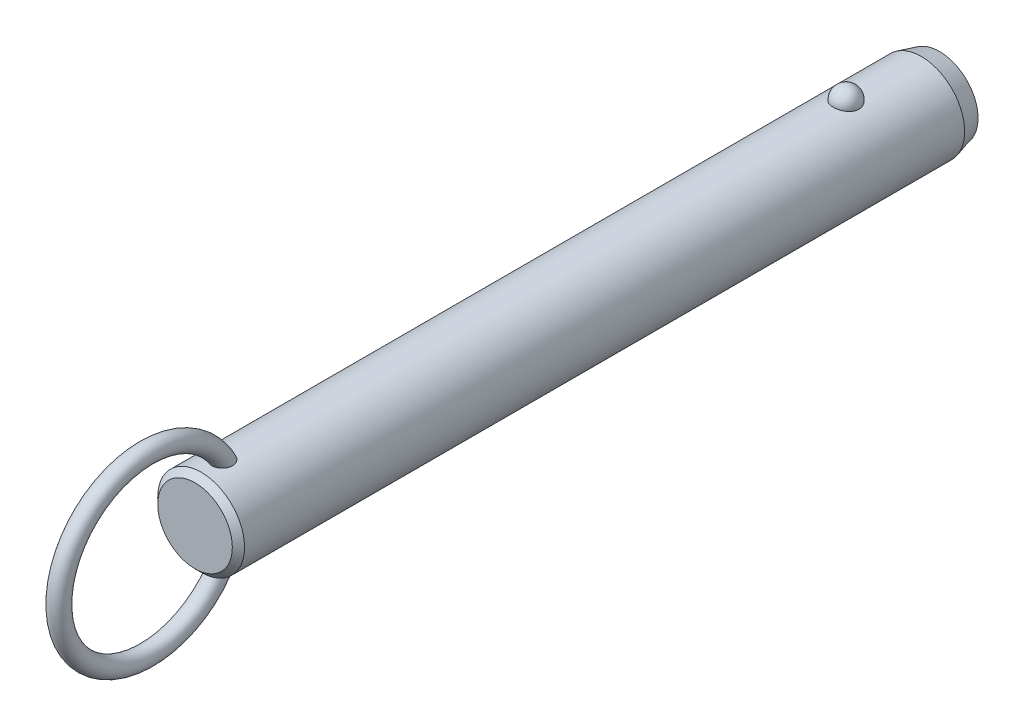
ISO-10303-21;
HEADER;
FILE_DESCRIPTION(('STEP AP214'),'2;1');
FILE_NAME('part.step','',(''),(''),'','','');
FILE_SCHEMA(('AUTOMOTIVE_DESIGN { 1 0 10303 214 1 1 1 1 }'));
ENDSEC;
DATA;
#1=APPLICATION_CONTEXT('core data for automotive mechanical design processes');
#2=APPLICATION_PROTOCOL_DEFINITION('international standard','automotive_design',2000,#1);
#3=PRODUCT_CONTEXT('',#1,'mechanical');
#4=PRODUCT('Part','Part','',(#3));
#5=PRODUCT_RELATED_PRODUCT_CATEGORY('part','',(#4));
#6=PRODUCT_DEFINITION_FORMATION('','',#4);
#7=PRODUCT_DEFINITION_CONTEXT('part definition',#1,'design');
#8=PRODUCT_DEFINITION('design','',#6,#7);
#9=PRODUCT_DEFINITION_SHAPE('','',#8);
#10=(LENGTH_UNIT() NAMED_UNIT(*) SI_UNIT(.MILLI.,.METRE.));
#11=(NAMED_UNIT(*) PLANE_ANGLE_UNIT() SI_UNIT($,.RADIAN.));
#12=(NAMED_UNIT(*) SI_UNIT($,.STERADIAN.) SOLID_ANGLE_UNIT());
#13=UNCERTAINTY_MEASURE_WITH_UNIT(LENGTH_MEASURE(1.E-05),#10,'distance_accuracy_value','');
#14=(GEOMETRIC_REPRESENTATION_CONTEXT(3) GLOBAL_UNCERTAINTY_ASSIGNED_CONTEXT((#13)) GLOBAL_UNIT_ASSIGNED_CONTEXT((#10,
#11,#12)) REPRESENTATION_CONTEXT('',''));
#15=CARTESIAN_POINT('',(0.,0.,0.));
#16=DIRECTION('',(0.,0.,1.));
#17=DIRECTION('',(1.,0.,0.));
#18=AXIS2_PLACEMENT_3D('',#15,#16,#17);
#19=CARTESIAN_POINT('',(0.,0.,96.5));
#20=DIRECTION('',(0.,0.,-1.));
#21=DIRECTION('',(-1.,0.,0.));
#22=AXIS2_PLACEMENT_3D('',#19,#20,#21);
#23=CYLINDRICAL_SURFACE('',#22,7.1);
#24=CARTESIAN_POINT('',(2.0769088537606,6.78943661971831,-2.1));
#25=CARTESIAN_POINT('',(2.07690739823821,6.78943796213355,-1.98268154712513));
#26=CARTESIAN_POINT('',(2.06738130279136,6.79237331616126,-1.86534506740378));
#27=CARTESIAN_POINT('',(2.0295040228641,6.8037853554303,-1.63400788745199));
#28=CARTESIAN_POINT('',(2.00114757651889,6.81226358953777,-1.52000812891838));
#29=CARTESIAN_POINT('',(1.92632025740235,6.83379798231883,-1.29863433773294));
#30=CARTESIAN_POINT('',(1.87985726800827,6.84685214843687,-1.19125744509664));
#31=CARTESIAN_POINT('',(1.76995205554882,6.87608091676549,-0.98604657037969));
#32=CARTESIAN_POINT('',(1.70650980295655,6.8922555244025,-0.88821260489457));
#33=CARTESIAN_POINT('',(1.5638119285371,6.92602930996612,-0.704242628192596));
#34=CARTESIAN_POINT('',(1.4844714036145,6.94363582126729,-0.618173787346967));
#35=CARTESIAN_POINT('',(1.31221746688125,6.97823658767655,-0.460740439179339));
#36=CARTESIAN_POINT('',(1.21930409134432,6.99523084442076,-0.389375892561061));
#37=CARTESIAN_POINT('',(1.02268781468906,7.02666176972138,-0.263547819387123));
#38=CARTESIAN_POINT('',(0.91902009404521,7.04110638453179,-0.209031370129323));
#39=CARTESIAN_POINT('',(0.703548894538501,7.06588726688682,-0.118163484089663));
#40=CARTESIAN_POINT('',(0.591746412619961,7.07622403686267,-0.0818098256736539));
#41=CARTESIAN_POINT('',(0.365557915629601,7.09147068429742,-0.0288711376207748));
#42=CARTESIAN_POINT('',(0.251267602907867,7.09648447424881,-0.0119070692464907));
#43=CARTESIAN_POINT('',(0.0213499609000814,7.10089837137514,0.00304925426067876));
#44=CARTESIAN_POINT('',(-0.0942772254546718,7.10029907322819,0.00104351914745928));
#45=CARTESIAN_POINT('',(-0.321651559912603,7.09360829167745,-0.0216931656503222));
#46=CARTESIAN_POINT('',(-0.433431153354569,7.08760388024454,-0.0421272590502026));
#47=CARTESIAN_POINT('',(-0.651862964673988,7.07086131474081,-0.100729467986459));
#48=CARTESIAN_POINT('',(-0.758515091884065,7.06012307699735,-0.138897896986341));
#49=CARTESIAN_POINT('',(-0.964449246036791,7.03496097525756,-0.232213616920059));
#50=CARTESIAN_POINT('',(-1.06368095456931,7.02051445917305,-0.287465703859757));
#51=CARTESIAN_POINT('',(-1.25145353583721,6.98948740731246,-0.413383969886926));
#52=CARTESIAN_POINT('',(-1.33999321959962,6.97290663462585,-0.48405186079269));
#53=CARTESIAN_POINT('',(-1.50591604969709,6.93898770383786,-0.640594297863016));
#54=CARTESIAN_POINT('',(-1.58302488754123,6.92164094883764,-0.726757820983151));
#55=CARTESIAN_POINT('',(-1.72189320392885,6.8884103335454,-0.91092752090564));
#56=CARTESIAN_POINT('',(-1.78365144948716,6.87252659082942,-1.008934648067));
#57=CARTESIAN_POINT('',(-1.89101272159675,6.84377189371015,-1.21549497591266));
#58=CARTESIAN_POINT('',(-1.93639553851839,6.83094274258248,-1.32416860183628));
#59=CARTESIAN_POINT('',(-2.00874275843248,6.81002070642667,-1.54791500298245));
#60=CARTESIAN_POINT('',(-2.03570774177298,6.80192767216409,-1.66298757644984));
#61=CARTESIAN_POINT('',(-2.07047276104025,6.7914266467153,-1.89571453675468));
#62=CARTESIAN_POINT('',(-2.07835878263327,6.78899315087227,-2.01335491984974));
#63=CARTESIAN_POINT('',(-2.07502083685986,6.79001409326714,-2.24833570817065));
#64=CARTESIAN_POINT('',(-2.06379746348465,6.7934683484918,-2.36567612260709));
#65=CARTESIAN_POINT('',(-2.02263913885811,6.80583442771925,-2.59603194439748));
#66=CARTESIAN_POINT('',(-1.99281127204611,6.81471501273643,-2.70906820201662));
#67=CARTESIAN_POINT('',(-1.91526639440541,6.83691232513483,-2.92836575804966));
#68=CARTESIAN_POINT('',(-1.8675486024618,6.85022924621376,-3.03462676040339));
#69=CARTESIAN_POINT('',(-1.75504492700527,6.87991336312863,-3.23806487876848));
#70=CARTESIAN_POINT('',(-1.69015924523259,6.89629822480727,-3.33518422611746));
#71=CARTESIAN_POINT('',(-1.54505404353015,6.93024852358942,-3.51697105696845));
#72=CARTESIAN_POINT('',(-1.46483385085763,6.94781401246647,-3.60163799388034));
#73=CARTESIAN_POINT('',(-1.29071406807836,6.98225977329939,-3.75654119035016));
#74=CARTESIAN_POINT('',(-1.19675650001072,6.99913673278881,-3.82671308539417));
#75=CARTESIAN_POINT('',(-0.997940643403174,7.03023618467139,-3.9501837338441));
#76=CARTESIAN_POINT('',(-0.89308318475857,7.04445887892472,-4.00348377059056));
#77=CARTESIAN_POINT('',(-0.676902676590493,7.06848365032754,-4.09107242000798));
#78=CARTESIAN_POINT('',(-0.565686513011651,7.0783430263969,-4.12560889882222));
#79=CARTESIAN_POINT('',(-0.338739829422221,7.09282534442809,-4.17575450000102));
#80=CARTESIAN_POINT('',(-0.223009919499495,7.09744899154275,-4.19136617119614));
#81=CARTESIAN_POINT('',(0.00707628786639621,7.10090930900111,-4.20307965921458));
#82=CARTESIAN_POINT('',(0.121410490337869,7.09986531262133,-4.19958377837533));
#83=CARTESIAN_POINT('',(0.347815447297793,7.092380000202,-4.17411564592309));
#84=CARTESIAN_POINT('',(0.459886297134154,7.08593891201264,-4.15214417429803));
#85=CARTESIAN_POINT('',(0.678084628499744,7.06838983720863,-4.09049562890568));
#86=CARTESIAN_POINT('',(0.784237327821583,7.05730369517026,-4.05090137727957));
#87=CARTESIAN_POINT('',(0.988305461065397,7.03163139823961,-3.95511447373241));
#88=CARTESIAN_POINT('',(1.08622031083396,7.01704499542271,-3.89892064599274));
#89=CARTESIAN_POINT('',(1.27284490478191,6.98562668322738,-3.77035541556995));
#90=CARTESIAN_POINT('',(1.36137372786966,6.96876135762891,-3.69772964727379));
#91=CARTESIAN_POINT('',(1.52509486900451,6.93477412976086,-3.53878279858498));
#92=CARTESIAN_POINT('',(1.60028496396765,6.91765218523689,-3.45245943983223));
#93=CARTESIAN_POINT('',(1.73681688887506,6.88465753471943,-3.26658774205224));
#94=CARTESIAN_POINT('',(1.79785966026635,6.86881574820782,-3.16681408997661));
#95=CARTESIAN_POINT('',(1.90265327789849,6.84053157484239,-2.95814408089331));
#96=CARTESIAN_POINT('',(1.94640861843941,6.82808830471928,-2.84925010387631));
#97=CARTESIAN_POINT('',(2.01274378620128,6.80881460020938,-2.63454318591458));
#98=CARTESIAN_POINT('',(2.03676193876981,6.80160856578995,-2.52920574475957));
#99=CARTESIAN_POINT('',(2.06884490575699,6.79191902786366,-2.3159172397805));
#100=CARTESIAN_POINT('',(2.07691019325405,6.78943538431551,-2.20796625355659));
#101=CARTESIAN_POINT('',(2.0769088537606,6.78943661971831,-2.1));
#102=B_SPLINE_CURVE_WITH_KNOTS('',3,(#24,#25,#26,#27,#28,#29,#30,#31,#32,#33,#34,#35,#36,#37,
#38,#39,#40,#41,#42,#43,#44,#45,#46,#47,#48,#49,#50,#51,#52,#53,#54,#55,#56,#57,#58,#59,#60,#61,
#62,#63,#64,#65,#66,#67,#68,#69,#70,#71,#72,#73,#74,#75,#76,#77,#78,#79,#80,#81,#82,#83,#84,#85,
#86,#87,#88,#89,#90,#91,#92,#93,#94,#95,#96,#97,#98,#99,#100,#101),.UNSPECIFIED.,.T.,.F.,(4,2,2,
2,2,2,2,2,2,2,2,2,2,2,2,2,2,2,2,2,2,2,2,2,2,2,2,2,2,2,2,2,2,2,2,2,2,2,4),(0.,0.351568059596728,
0.703234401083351,1.05474780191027,1.40626181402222,1.75970563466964,2.11314851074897,
2.4654696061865,2.81774759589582,3.16301449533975,3.50824481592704,3.84801136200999,
4.18778391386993,4.52968352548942,4.87162112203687,5.22076181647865,5.56993054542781,
5.92363364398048,6.27732559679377,6.62942052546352,6.98150450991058,7.33158042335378,
7.68167162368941,8.03384443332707,8.38603269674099,8.73975272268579,9.09344583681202,
9.44234545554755,9.79119807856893,10.1327344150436,10.4742563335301,10.8141898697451,
11.1541474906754,11.4997793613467,11.8454687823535,12.1979079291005,12.5502553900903,
12.8738073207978,13.1973496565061),.UNSPECIFIED.);
#103=CARTESIAN_POINT('',(2.0769088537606,6.78943661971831,-2.1));
#104=VERTEX_POINT('',#103);
#105=EDGE_CURVE('E41',#104,#104,#102,.T.);
#106=ORIENTED_EDGE('',*,*,#105,.T.);
#107=EDGE_LOOP('',(#106));
#108=FACE_BOUND('',#107,.T.);
#109=CARTESIAN_POINT('',(0.,0.,103.42));
#110=DIRECTION('',(0.,0.,1.));
#111=DIRECTION('',(1.,0.,0.));
#112=AXIS2_PLACEMENT_3D('',#109,#110,#111);
#113=CIRCLE('',#112,7.1);
#114=CARTESIAN_POINT('',(7.1,0.,103.42));
#115=VERTEX_POINT('',#114);
#116=EDGE_CURVE('E10',#115,#115,#113,.F.);
#117=ORIENTED_EDGE('',*,*,#116,.T.);
#118=EDGE_LOOP('',(#117));
#119=FACE_BOUND('',#118,.T.);
#120=CARTESIAN_POINT('',(-0.429539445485,-7.08699541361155,98.2429212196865));
#121=CARTESIAN_POINT('',(-0.508331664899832,-7.08221999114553,98.2668764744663));
#122=CARTESIAN_POINT('',(-0.58503984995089,-7.07624016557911,98.2974570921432));
#123=CARTESIAN_POINT('',(-0.732082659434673,-7.06254296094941,98.3710242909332));
#124=CARTESIAN_POINT('',(-0.802417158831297,-7.05482554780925,98.4140111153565));
#125=CARTESIAN_POINT('',(-0.934722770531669,-7.03851844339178,98.5111135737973));
#126=CARTESIAN_POINT('',(-0.99670020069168,-7.02992941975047,98.5652207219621));
#127=CARTESIAN_POINT('',(-1.11079942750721,-7.01280697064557,98.6829676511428));
#128=CARTESIAN_POINT('',(-1.16292136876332,-7.00427354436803,98.7466072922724));
#129=CARTESIAN_POINT('',(-1.25705660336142,-6.98799959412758,98.8826870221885));
#130=CARTESIAN_POINT('',(-1.29888032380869,-6.98027525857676,98.9552598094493));
#131=CARTESIAN_POINT('',(-1.37069920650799,-6.96652886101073,99.1061686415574));
#132=CARTESIAN_POINT('',(-1.40069157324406,-6.96050720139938,99.1845060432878));
#133=CARTESIAN_POINT('',(-1.45043507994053,-6.95031881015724,99.3501903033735));
#134=CARTESIAN_POINT('',(-1.46937115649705,-6.94630231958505,99.4377897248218));
#135=CARTESIAN_POINT('',(-1.49424917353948,-6.94099239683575,99.6148714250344));
#136=CARTESIAN_POINT('',(-1.50018601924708,-6.93970003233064,99.7043544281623));
#137=CARTESIAN_POINT('',(-1.49978214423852,-6.93978815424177,99.8940607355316));
#138=CARTESIAN_POINT('',(-1.49187639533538,-6.94150934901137,99.994279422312));
#139=CARTESIAN_POINT('',(-1.46177925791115,-6.94790814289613,100.192479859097));
#140=CARTESIAN_POINT('',(-1.43957541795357,-6.95258831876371,100.290459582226));
#141=CARTESIAN_POINT('',(-1.37783293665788,-6.96510647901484,100.49536292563));
#142=CARTESIAN_POINT('',(-1.33634073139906,-6.97328848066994,100.601680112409));
#143=CARTESIAN_POINT('',(-1.23686994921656,-6.99161706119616,100.806177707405));
#144=CARTESIAN_POINT('',(-1.17889192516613,-7.00176357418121,100.904358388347));
#145=CARTESIAN_POINT('',(-1.0587512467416,-7.02082898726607,101.072374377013));
#146=CARTESIAN_POINT('',(-0.999247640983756,-7.02963746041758,101.144123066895));
#147=CARTESIAN_POINT('',(-0.869494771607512,-7.04686074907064,101.277195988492));
#148=CARTESIAN_POINT('',(-0.799263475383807,-7.05527619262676,101.338537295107));
#149=CARTESIAN_POINT('',(-0.665408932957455,-7.06899457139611,101.435131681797));
#150=CARTESIAN_POINT('',(-0.603817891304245,-7.07457275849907,101.473151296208));
#151=CARTESIAN_POINT('',(-0.47517283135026,-7.08437420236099,101.538758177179));
#152=CARTESIAN_POINT('',(-0.408123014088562,-7.08859848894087,101.566353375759));
#153=CARTESIAN_POINT('',(-0.269431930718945,-7.09522749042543,101.609256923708));
#154=CARTESIAN_POINT('',(-0.197757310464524,-7.09761688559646,101.624461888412));
#155=CARTESIAN_POINT('',(-0.0527849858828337,-7.10017268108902,101.640716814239));
#156=CARTESIAN_POINT('',(0.0205115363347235,-7.10034065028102,101.641776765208));
#157=CARTESIAN_POINT('',(0.156426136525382,-7.09855986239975,101.630461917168));
#158=CARTESIAN_POINT('',(0.219199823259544,-7.09688191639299,101.619806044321));
#159=CARTESIAN_POINT('',(0.342134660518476,-7.09201880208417,101.588537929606));
#160=CARTESIAN_POINT('',(0.402295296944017,-7.08883333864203,101.567923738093));
#161=CARTESIAN_POINT('',(0.520687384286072,-7.08113868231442,101.517212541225));
#162=CARTESIAN_POINT('',(0.578791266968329,-7.07658958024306,101.486827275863));
#163=CARTESIAN_POINT('',(0.690173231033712,-7.06659708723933,101.418367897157));
#164=CARTESIAN_POINT('',(0.743447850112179,-7.061153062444,101.380288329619));
#165=CARTESIAN_POINT('',(0.870947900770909,-7.04680292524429,101.276592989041));
#166=CARTESIAN_POINT('',(0.941828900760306,-7.0375580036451,101.206897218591));
#167=CARTESIAN_POINT('',(1.07136606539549,-7.01900793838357,101.056945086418));
#168=CARTESIAN_POINT('',(1.13000013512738,-7.00970271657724,100.976670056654));
#169=CARTESIAN_POINT('',(1.23579584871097,-6.99183327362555,100.806899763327));
#170=CARTESIAN_POINT('',(1.2827427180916,-6.98328455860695,100.717269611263));
#171=CARTESIAN_POINT('',(1.36351442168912,-6.96796352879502,100.532176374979));
#172=CARTESIAN_POINT('',(1.39733971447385,-6.96119115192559,100.436713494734));
#173=CARTESIAN_POINT('',(1.45579181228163,-6.94922464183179,100.22530928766));
#174=CARTESIAN_POINT('',(1.47790145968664,-6.94449000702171,100.108631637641));
#175=CARTESIAN_POINT('',(1.50168752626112,-6.93938731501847,99.8730153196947));
#176=CARTESIAN_POINT('',(1.50336085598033,-6.93901991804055,99.7540763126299));
#177=CARTESIAN_POINT('',(1.48486516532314,-6.9430010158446,99.5236079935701));
#178=CARTESIAN_POINT('',(1.46573441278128,-6.9471253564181,99.411995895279));
#179=CARTESIAN_POINT('',(1.40606892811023,-6.95944667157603,99.1948868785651));
#180=CARTESIAN_POINT('',(1.36556446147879,-6.96763788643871,99.0893815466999));
#181=CARTESIAN_POINT('',(1.27082700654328,-6.98548038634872,98.9042879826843));
#182=CARTESIAN_POINT('',(1.21949810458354,-6.99473841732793,98.8231719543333));
#183=CARTESIAN_POINT('',(1.10242050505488,-7.01414069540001,98.6722278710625));
#184=CARTESIAN_POINT('',(1.03668119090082,-7.02428436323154,98.6023925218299));
#185=CARTESIAN_POINT('',(0.900559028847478,-7.04295285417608,98.4835735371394));
#186=CARTESIAN_POINT('',(0.83142884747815,-7.05153466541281,98.4331573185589));
#187=CARTESIAN_POINT('',(0.68529187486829,-7.06723150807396,98.3451429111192));
#188=CARTESIAN_POINT('',(0.608287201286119,-7.0743469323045,98.3075412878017));
#189=CARTESIAN_POINT('',(0.451878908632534,-7.08602232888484,98.2474915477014));
#190=CARTESIAN_POINT('',(0.372686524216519,-7.09067127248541,98.2245088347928));
#191=CARTESIAN_POINT('',(0.211477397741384,-7.09730788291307,98.1920357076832));
#192=CARTESIAN_POINT('',(0.129460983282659,-7.09929585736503,98.1825437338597));
#193=CARTESIAN_POINT('',(-0.0332905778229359,-7.10037858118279,98.1773517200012));
#194=CARTESIAN_POINT('',(-0.114016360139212,-7.09953334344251,98.1813656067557));
#195=CARTESIAN_POINT('',(-0.273670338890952,-7.09517338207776,98.2024540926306));
#196=CARTESIAN_POINT('',(-0.352598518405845,-7.09165863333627,98.2195288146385));
#197=CARTESIAN_POINT('',(-0.429539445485,-7.08699541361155,98.2429212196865));
#198=B_SPLINE_CURVE_WITH_KNOTS('',3,(#120,#121,#122,#123,#124,#125,#126,#127,#128,#129,#130,
#131,#132,#133,#134,#135,#136,#137,#138,#139,#140,#141,#142,#143,#144,#145,#146,#147,#148,#149,
#150,#151,#152,#153,#154,#155,#156,#157,#158,#159,#160,#161,#162,#163,#164,#165,#166,#167,#168,
#169,#170,#171,#172,#173,#174,#175,#176,#177,#178,#179,#180,#181,#182,#183,#184,#185,#186,#187,
#188,#189,#190,#191,#192,#193,#194,#195,#196,#197),.UNSPECIFIED.,.T.,.F.,(4,2,2,2,2,2,2,2,2,2,2,
2,2,2,2,2,2,2,2,2,2,2,2,2,2,2,2,2,2,2,2,2,2,2,2,2,2,2,4),(0.,0.247183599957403,
0.494372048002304,0.741372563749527,0.988369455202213,1.23962059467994,1.49093106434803,
1.75897818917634,2.02713035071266,2.32758265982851,2.62829697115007,2.97008736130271,
3.31186629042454,3.59175319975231,3.87117637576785,4.08813841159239,4.30493502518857,
4.52352259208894,4.74195577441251,4.9321532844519,5.12238804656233,5.31884850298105,
5.51544871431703,5.81332317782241,6.11173048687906,6.41527266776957,6.71880423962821,
7.07358156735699,7.42841252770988,7.76631485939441,8.10373999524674,8.39142246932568,
8.67891817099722,8.93560332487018,9.19221962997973,9.43881106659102,9.68537399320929,
9.92674752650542,10.1681233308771),.UNSPECIFIED.);
#199=CARTESIAN_POINT('',(-0.429539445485,-7.08699541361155,98.2429212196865));
#200=VERTEX_POINT('',#199);
#201=EDGE_CURVE('E59',#200,#200,#198,.T.);
#202=ORIENTED_EDGE('',*,*,#201,.T.);
#203=EDGE_LOOP('',(#202));
#204=FACE_BOUND('',#203,.T.);
#205=CARTESIAN_POINT('',(-0.429539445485,7.08699541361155,98.2429212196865));
#206=CARTESIAN_POINT('',(-0.351665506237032,7.09171429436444,98.2192469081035));
#207=CARTESIAN_POINT('',(-0.271733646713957,7.09525896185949,98.2020369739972));
#208=CARTESIAN_POINT('',(-0.110026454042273,7.09960839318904,98.1810059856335));
#209=CARTESIAN_POINT('',(-0.028250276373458,7.10041187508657,98.177191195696));
#210=CARTESIAN_POINT('',(0.134782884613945,7.09918849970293,98.183059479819));
#211=CARTESIAN_POINT('',(0.21603995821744,7.09716214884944,98.1927401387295));
#212=CARTESIAN_POINT('',(0.375730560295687,7.09050177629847,98.2253471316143));
#213=CARTESIAN_POINT('',(0.454164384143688,7.08586802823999,98.2482720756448));
#214=CARTESIAN_POINT('',(0.60602533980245,7.07449911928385,98.306771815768));
#215=CARTESIAN_POINT('',(0.679451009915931,7.06776334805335,98.3423502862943));
#216=CARTESIAN_POINT('',(0.819234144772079,7.05292866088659,98.4251753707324));
#217=CARTESIAN_POINT('',(0.885591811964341,7.04482978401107,98.4724216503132));
#218=CARTESIAN_POINT('',(1.00993211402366,7.02808709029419,98.5775902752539));
#219=CARTESIAN_POINT('',(1.06785399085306,7.01943990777,98.635583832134));
#220=CARTESIAN_POINT('',(1.17342527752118,7.00256662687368,98.7603013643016));
#221=CARTESIAN_POINT('',(1.22107408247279,6.99434055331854,98.8270258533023));
#222=CARTESIAN_POINT('',(1.30652927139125,6.97889183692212,98.9693622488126));
#223=CARTESIAN_POINT('',(1.34399711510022,6.97170674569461,99.0451808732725));
#224=CARTESIAN_POINT('',(1.40682616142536,6.95930080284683,99.2018100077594));
#225=CARTESIAN_POINT('',(1.43218374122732,6.95408053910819,99.2826220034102));
#226=CARTESIAN_POINT('',(1.47246409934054,6.94566853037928,99.4535314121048));
#227=CARTESIAN_POINT('',(1.48642590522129,6.9426653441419,99.5438630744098));
#228=CARTESIAN_POINT('',(1.5011410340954,6.93949744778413,99.725619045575));
#229=CARTESIAN_POINT('',(1.50188917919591,6.93933385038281,99.8170437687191));
#230=CARTESIAN_POINT('',(1.49030464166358,6.94183245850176,100.01084381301));
#231=CARTESIAN_POINT('',(1.47627413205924,6.94486147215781,100.113112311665));
#232=CARTESIAN_POINT('',(1.43356351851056,6.95380194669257,100.314471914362));
#233=CARTESIAN_POINT('',(1.4048676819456,6.95971650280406,100.413559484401));
#234=CARTESIAN_POINT('',(1.32908750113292,6.97461208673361,100.618908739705));
#235=CARTESIAN_POINT('',(1.28011435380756,6.98388945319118,100.724456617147));
#236=CARTESIAN_POINT('',(1.16520357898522,7.00397743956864,100.925760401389));
#237=CARTESIAN_POINT('',(1.09927694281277,7.01478706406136,101.021522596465));
#238=CARTESIAN_POINT('',(0.969361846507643,7.03373936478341,101.176756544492));
#239=CARTESIAN_POINT('',(0.909042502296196,7.04187023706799,101.239303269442));
#240=CARTESIAN_POINT('',(0.779178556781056,7.05741732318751,101.354053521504));
#241=CARTESIAN_POINT('',(0.709649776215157,7.06483472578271,101.406274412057));
#242=CARTESIAN_POINT('',(0.576854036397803,7.0767751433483,101.488113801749));
#243=CARTESIAN_POINT('',(0.515118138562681,7.08158033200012,101.520164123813));
#244=CARTESIAN_POINT('',(0.387127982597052,7.08972701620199,101.573765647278));
#245=CARTESIAN_POINT('',(0.320877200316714,7.09306962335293,101.595324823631));
#246=CARTESIAN_POINT('',(0.185041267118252,7.09791507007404,101.626400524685));
#247=CARTESIAN_POINT('',(0.115437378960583,7.09940591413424,101.635838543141));
#248=CARTESIAN_POINT('',(-0.0243157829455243,7.10030171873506,101.641522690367));
#249=CARTESIAN_POINT('',(-0.0944648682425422,7.0997073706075,101.637773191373));
#250=CARTESIAN_POINT('',(-0.225713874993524,7.09668414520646,101.618508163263));
#251=CARTESIAN_POINT('',(-0.287006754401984,7.09444865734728,101.604232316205));
#252=CARTESIAN_POINT('',(-0.40655537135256,7.08860360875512,101.566368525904));
#253=CARTESIAN_POINT('',(-0.46480981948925,7.08499346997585,101.542776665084));
#254=CARTESIAN_POINT('',(-0.594955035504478,7.07541654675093,101.478923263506));
#255=CARTESIAN_POINT('',(-0.665389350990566,7.06906574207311,101.435753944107));
#256=CARTESIAN_POINT('',(-0.798242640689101,7.05530261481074,101.338587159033));
#257=CARTESIAN_POINT('',(-0.860645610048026,7.0478882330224,101.284568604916));
#258=CARTESIAN_POINT('',(-0.994249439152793,7.03045217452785,101.150996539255));
#259=CARTESIAN_POINT('',(-1.06260129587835,7.02030745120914,101.068614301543));
#260=CARTESIAN_POINT('',(-1.18502045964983,7.00068382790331,100.893843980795));
#261=CARTESIAN_POINT('',(-1.23907684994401,6.99120544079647,100.801448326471));
#262=CARTESIAN_POINT('',(-1.33335589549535,6.97384343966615,100.608008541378));
#263=CARTESIAN_POINT('',(-1.37336138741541,6.96598557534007,100.506856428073));
#264=CARTESIAN_POINT('',(-1.43770677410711,6.9529905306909,100.299504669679));
#265=CARTESIAN_POINT('',(-1.46204473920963,6.94785368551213,100.19330440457));
#266=CARTESIAN_POINT('',(-1.49537533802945,6.94076296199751,99.9682317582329));
#267=CARTESIAN_POINT('',(-1.50273564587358,6.93914842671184,99.8490975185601));
#268=CARTESIAN_POINT('',(-1.4954555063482,6.94072368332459,99.6114703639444));
#269=CARTESIAN_POINT('',(-1.48082914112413,6.94391040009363,99.4929770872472));
#270=CARTESIAN_POINT('',(-1.43076401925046,6.95438579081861,99.2734325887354));
#271=CARTESIAN_POINT('',(-1.39762227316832,6.96121852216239,99.1718413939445));
#272=CARTESIAN_POINT('',(-1.31211274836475,6.97783941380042,98.9773513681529));
#273=CARTESIAN_POINT('',(-1.2597660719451,6.98762432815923,98.8844431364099));
#274=CARTESIAN_POINT('',(-1.14583073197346,7.00713153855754,98.7241601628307));
#275=CARTESIAN_POINT('',(-1.0866594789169,7.01665982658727,98.6550351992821));
#276=CARTESIAN_POINT('',(-0.956606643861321,7.03556646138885,98.5288786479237));
#277=CARTESIAN_POINT('',(-0.88573712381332,7.04494495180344,98.4718347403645));
#278=CARTESIAN_POINT('',(-0.75155804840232,7.06035735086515,98.3831004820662));
#279=CARTESIAN_POINT('',(-0.690120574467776,7.0666695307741,98.3485932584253));
#280=CARTESIAN_POINT('',(-0.562815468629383,7.07794609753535,98.2887507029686));
#281=CARTESIAN_POINT('',(-0.496948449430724,7.08291067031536,98.2634141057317));
#282=CARTESIAN_POINT('',(-0.429539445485,7.08699541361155,98.2429212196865));
#283=B_SPLINE_CURVE_WITH_KNOTS('',3,(#205,#206,#207,#208,#209,#210,#211,#212,#213,#214,#215,
#216,#217,#218,#219,#220,#221,#222,#223,#224,#225,#226,#227,#228,#229,#230,#231,#232,#233,#234,
#235,#236,#237,#238,#239,#240,#241,#242,#243,#244,#245,#246,#247,#248,#249,#250,#251,#252,#253,
#254,#255,#256,#257,#258,#259,#260,#261,#262,#263,#264,#265,#266,#267,#268,#269,#270,#271,#272,
#273,#274,#275,#276,#277,#278,#279,#280,#281,#282),.UNSPECIFIED.,.T.,.F.,(4,2,2,2,2,2,2,2,2,2,2,
2,2,2,2,2,2,2,2,2,2,2,2,2,2,2,2,2,2,2,2,2,2,2,2,2,2,2,4),(0.,0.244335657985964,
0.488785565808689,0.733191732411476,0.977572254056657,1.22202379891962,1.46646834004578,
1.71259457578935,1.95873529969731,2.21226768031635,2.46587585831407,2.7391381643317,
3.01250754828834,3.32109936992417,3.63002293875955,3.97863512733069,4.32702187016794,
4.58793945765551,4.84841449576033,5.05676704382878,5.26496096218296,5.47449661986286,
5.68396281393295,5.87205447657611,6.06022532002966,6.30743751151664,6.55513496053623,
6.87602468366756,7.19715875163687,7.52305774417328,7.84899686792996,8.20516155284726,
8.56109821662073,8.88040084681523,9.19935367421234,9.47236282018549,9.74509220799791,
9.9566225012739,10.1681235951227),.UNSPECIFIED.);
#284=CARTESIAN_POINT('',(-0.429539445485,7.08699541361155,98.2429212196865));
#285=VERTEX_POINT('',#284);
#286=EDGE_CURVE('E67',#285,#285,#283,.T.);
#287=ORIENTED_EDGE('',*,*,#286,.T.);
#288=EDGE_LOOP('',(#287));
#289=FACE_BOUND('',#288,.T.);
#290=CARTESIAN_POINT('',(0.,0.,-14.4));
#291=DIRECTION('',(0.,0.,-1.));
#292=DIRECTION('',(-1.,0.,0.));
#293=AXIS2_PLACEMENT_3D('',#290,#291,#292);
#294=CIRCLE('',#293,7.1);
#295=CARTESIAN_POINT('',(-7.1,0.,-14.4));
#296=VERTEX_POINT('',#295);
#297=EDGE_CURVE('E56',#296,#296,#294,.F.);
#298=ORIENTED_EDGE('',*,*,#297,.T.);
#299=EDGE_LOOP('',(#298));
#300=FACE_BOUND('',#299,.T.);
#301=ADVANCED_FACE('F37',(#108,#119,#204,#289,#300),#23,.T.);
#302=CARTESIAN_POINT('',(0.,0.,-17.4));
#303=DIRECTION('',(0.,0.,-1.));
#304=DIRECTION('',(-1.,0.,0.));
#305=AXIS2_PLACEMENT_3D('',#302,#303,#304);
#306=PLANE('',#305);
#307=CARTESIAN_POINT('',(0.,0.,-17.4));
#308=DIRECTION('',(0.,0.,-1.));
#309=DIRECTION('',(-1.,0.,0.));
#310=AXIS2_PLACEMENT_3D('',#307,#308,#309);
#311=CIRCLE('',#310,6.29615242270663);
#312=CARTESIAN_POINT('',(-6.29615242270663,0.,-17.4));
#313=VERTEX_POINT('',#312);
#314=EDGE_CURVE('E66',#313,#313,#311,.T.);
#315=ORIENTED_EDGE('',*,*,#314,.T.);
#316=EDGE_LOOP('',(#315));
#317=FACE_BOUND('',#316,.T.);
#318=ADVANCED_FACE('F85',(#317),#306,.T.);
#319=CARTESIAN_POINT('',(0.,0.,-17.4));
#320=DIRECTION('',(0.,0.,1.));
#321=DIRECTION('',(1.,0.,0.));
#322=AXIS2_PLACEMENT_3D('',#319,#320,#321);
#323=CONICAL_SURFACE('',#322,6.29615242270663,0.261799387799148);
#324=ORIENTED_EDGE('',*,*,#297,.F.);
#325=EDGE_LOOP('',(#324));
#326=FACE_BOUND('',#325,.T.);
#327=ORIENTED_EDGE('',*,*,#314,.F.);
#328=EDGE_LOOP('',(#327));
#329=FACE_BOUND('',#328,.T.);
#330=ADVANCED_FACE('F83',(#326,#329),#323,.T.);
#331=CARTESIAN_POINT('',(0.,0.,104.42));
#332=DIRECTION('',(0.,0.,1.));
#333=DIRECTION('',(1.,0.,0.));
#334=AXIS2_PLACEMENT_3D('',#331,#332,#333);
#335=PLANE('',#334);
#336=CARTESIAN_POINT('',(0.,0.,104.42));
#337=DIRECTION('',(0.,0.,1.));
#338=DIRECTION('',(1.,0.,0.));
#339=AXIS2_PLACEMENT_3D('',#336,#337,#338);
#340=CIRCLE('',#339,6.10000000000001);
#341=CARTESIAN_POINT('',(6.10000000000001,0.,104.42));
#342=VERTEX_POINT('',#341);
#343=EDGE_CURVE('E50',#342,#342,#340,.T.);
#344=ORIENTED_EDGE('',*,*,#343,.T.);
#345=EDGE_LOOP('',(#344));
#346=FACE_BOUND('',#345,.T.);
#347=ADVANCED_FACE('F77',(#346),#335,.T.);
#348=CARTESIAN_POINT('',(0.,0.,112.35));
#349=DIRECTION('',(1.,0.,0.));
#350=DIRECTION('',(0.,0.,-1.));
#351=AXIS2_PLACEMENT_3D('',#348,#349,#350);
#352=TOROIDAL_SURFACE('',#351,14.35,1.5);
#353=ORIENTED_EDGE('',*,*,#286,.F.);
#354=EDGE_LOOP('',(#353));
#355=FACE_BOUND('',#354,.T.);
#356=ORIENTED_EDGE('',*,*,#201,.F.);
#357=EDGE_LOOP('',(#356));
#358=FACE_BOUND('',#357,.T.);
#359=ADVANCED_FACE('F73',(#355,#358),#352,.T.);
#360=CARTESIAN_POINT('',(0.,0.,104.42));
#361=DIRECTION('',(0.,0.,-1.));
#362=DIRECTION('',(-1.,0.,0.));
#363=AXIS2_PLACEMENT_3D('',#360,#361,#362);
#364=CONICAL_SURFACE('',#363,6.10000000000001,0.78539816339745);
#365=ORIENTED_EDGE('',*,*,#116,.F.);
#366=EDGE_LOOP('',(#365));
#367=FACE_BOUND('',#366,.T.);
#368=ORIENTED_EDGE('',*,*,#343,.F.);
#369=EDGE_LOOP('',(#368));
#370=FACE_BOUND('',#369,.T.);
#371=ADVANCED_FACE('F39',(#367,#370),#364,.T.);
#372=CARTESIAN_POINT('',(0.,7.1,-2.1));
#373=DIRECTION('',(0.,1.,0.));
#374=DIRECTION('',(0.,0.,1.));
#375=AXIS2_PLACEMENT_3D('',#372,#373,#374);
#376=SPHERICAL_SURFACE('',#375,2.10000000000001);
#377=ORIENTED_EDGE('',*,*,#105,.F.);
#378=EDGE_LOOP('',(#377));
#379=FACE_BOUND('',#378,.T.);
#380=ADVANCED_FACE('F79',(#379),#376,.T.);
#381=CLOSED_SHELL('',(#301,#318,#330,#347,#359,#371,#380));
#382=MANIFOLD_SOLID_BREP('B2',#381);
#383=ADVANCED_BREP_SHAPE_REPRESENTATION('',(#18,#382),#14);
#384=SHAPE_DEFINITION_REPRESENTATION(#9,#383);
ENDSEC;
END-ISO-10303-21;
